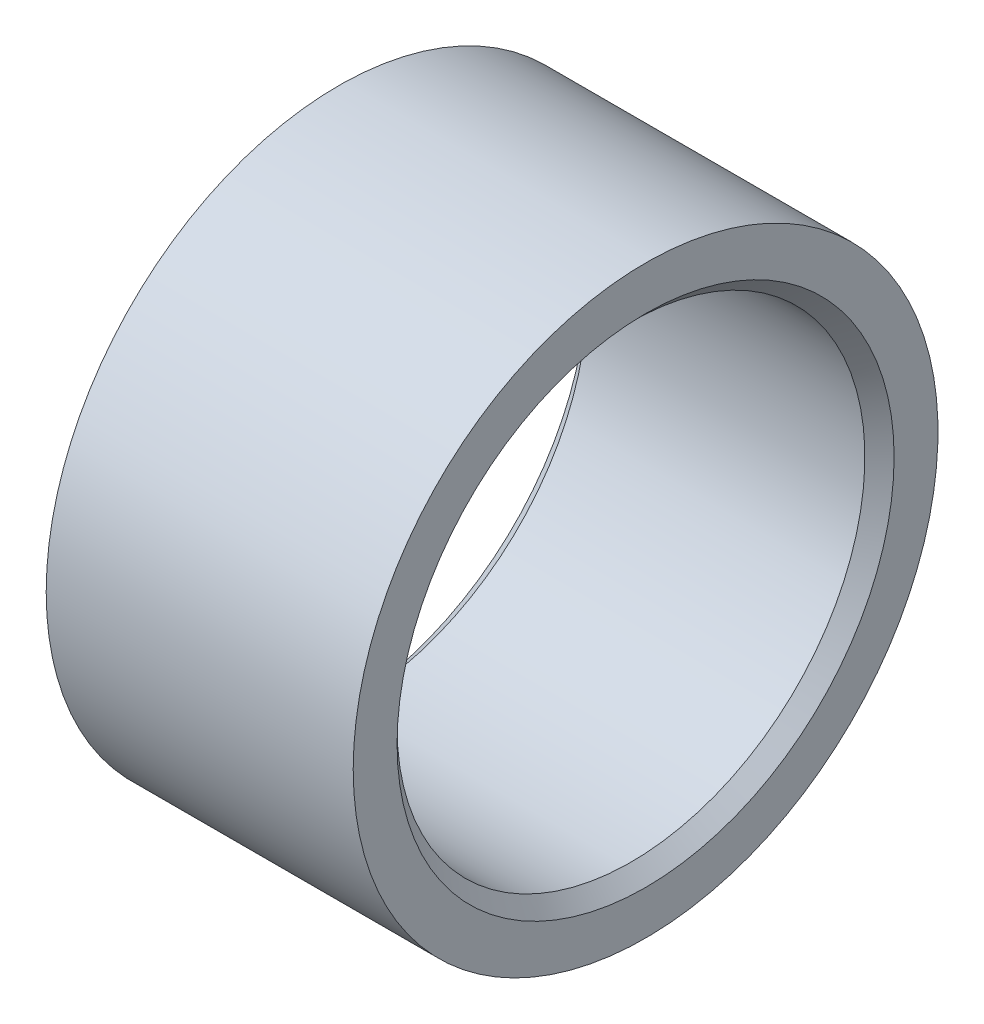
ISO-10303-21;
HEADER;
FILE_DESCRIPTION(('STEP AP214'),'2;1');
FILE_NAME('part.step','',(''),(''),'','','');
FILE_SCHEMA(('AUTOMOTIVE_DESIGN { 1 0 10303 214 1 1 1 1 }'));
ENDSEC;
DATA;
#1=APPLICATION_CONTEXT('core data for automotive mechanical design processes');
#2=APPLICATION_PROTOCOL_DEFINITION('international standard','automotive_design',2000,#1);
#3=PRODUCT_CONTEXT('',#1,'mechanical');
#4=PRODUCT('Part','Part','',(#3));
#5=PRODUCT_RELATED_PRODUCT_CATEGORY('part','',(#4));
#6=PRODUCT_DEFINITION_FORMATION('','',#4);
#7=PRODUCT_DEFINITION_CONTEXT('part definition',#1,'design');
#8=PRODUCT_DEFINITION('design','',#6,#7);
#9=PRODUCT_DEFINITION_SHAPE('','',#8);
#10=(LENGTH_UNIT() NAMED_UNIT(*) SI_UNIT(.MILLI.,.METRE.));
#11=(NAMED_UNIT(*) PLANE_ANGLE_UNIT() SI_UNIT($,.RADIAN.));
#12=(NAMED_UNIT(*) SI_UNIT($,.STERADIAN.) SOLID_ANGLE_UNIT());
#13=UNCERTAINTY_MEASURE_WITH_UNIT(LENGTH_MEASURE(1.E-05),#10,'distance_accuracy_value','');
#14=(GEOMETRIC_REPRESENTATION_CONTEXT(3) GLOBAL_UNCERTAINTY_ASSIGNED_CONTEXT((#13)) GLOBAL_UNIT_ASSIGNED_CONTEXT((#10,
#11,#12)) REPRESENTATION_CONTEXT('',''));
#15=CARTESIAN_POINT('',(0.,0.,0.));
#16=DIRECTION('',(0.,0.,1.));
#17=DIRECTION('',(1.,0.,0.));
#18=AXIS2_PLACEMENT_3D('',#15,#16,#17);
#19=CARTESIAN_POINT('',(0.,0.,0.));
#20=DIRECTION('',(-1.,0.,0.));
#21=DIRECTION('',(0.,0.,1.));
#22=AXIS2_PLACEMENT_3D('',#19,#20,#21);
#23=PLANE('',#22);
#24=CARTESIAN_POINT('',(0.,0.,0.));
#25=DIRECTION('',(-1.,0.,0.));
#26=DIRECTION('',(0.,0.,1.));
#27=AXIS2_PLACEMENT_3D('',#24,#25,#26);
#28=CIRCLE('',#27,17.);
#29=CARTESIAN_POINT('',(0.,0.,17.));
#30=VERTEX_POINT('',#29);
#31=EDGE_CURVE('E51',#30,#30,#28,.F.);
#32=ORIENTED_EDGE('',*,*,#31,.T.);
#33=EDGE_LOOP('',(#32));
#34=FACE_BOUND('',#33,.T.);
#35=CARTESIAN_POINT('',(0.,0.,0.));
#36=DIRECTION('',(-1.,0.,0.));
#37=DIRECTION('',(0.,0.,1.));
#38=AXIS2_PLACEMENT_3D('',#35,#36,#37);
#39=CIRCLE('',#38,20.);
#40=CARTESIAN_POINT('',(0.,0.,20.));
#41=VERTEX_POINT('',#40);
#42=EDGE_CURVE('E69',#41,#41,#39,.T.);
#43=ORIENTED_EDGE('',*,*,#42,.T.);
#44=EDGE_LOOP('',(#43));
#45=FACE_BOUND('',#44,.T.);
#46=ADVANCED_FACE('F43',(#34,#45),#23,.T.);
#47=CARTESIAN_POINT('',(0.,0.,0.));
#48=DIRECTION('',(-1.,0.,0.));
#49=DIRECTION('',(0.,0.,1.));
#50=AXIS2_PLACEMENT_3D('',#47,#48,#49);
#51=CYLINDRICAL_SURFACE('',#50,16.);
#52=CARTESIAN_POINT('',(1.00000000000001,0.,0.));
#53=DIRECTION('',(-1.,0.,0.));
#54=DIRECTION('',(0.,0.,1.));
#55=AXIS2_PLACEMENT_3D('',#52,#53,#54);
#56=CIRCLE('',#55,16.);
#57=CARTESIAN_POINT('',(1.00000000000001,0.,16.));
#58=VERTEX_POINT('',#57);
#59=EDGE_CURVE('E54',#58,#58,#56,.T.);
#60=ORIENTED_EDGE('',*,*,#59,.T.);
#61=EDGE_LOOP('',(#60));
#62=FACE_BOUND('',#61,.T.);
#63=CARTESIAN_POINT('',(20.,0.,0.));
#64=DIRECTION('',(-1.,0.,0.));
#65=DIRECTION('',(0.,0.,1.));
#66=AXIS2_PLACEMENT_3D('',#63,#64,#65);
#67=CIRCLE('',#66,16.);
#68=CARTESIAN_POINT('',(20.,0.,16.));
#69=VERTEX_POINT('',#68);
#70=EDGE_CURVE('E56',#69,#69,#67,.F.);
#71=ORIENTED_EDGE('',*,*,#70,.T.);
#72=EDGE_LOOP('',(#71));
#73=FACE_BOUND('',#72,.T.);
#74=ADVANCED_FACE('F85',(#62,#73),#51,.F.);
#75=CARTESIAN_POINT('',(21.,0.,0.));
#76=DIRECTION('',(-1.,0.,0.));
#77=DIRECTION('',(0.,0.,1.));
#78=AXIS2_PLACEMENT_3D('',#75,#76,#77);
#79=PLANE('',#78);
#80=CARTESIAN_POINT('',(21.,0.,0.));
#81=DIRECTION('',(-1.,0.,0.));
#82=DIRECTION('',(0.,0.,1.));
#83=AXIS2_PLACEMENT_3D('',#80,#81,#82);
#84=CIRCLE('',#83,17.);
#85=CARTESIAN_POINT('',(21.,0.,17.));
#86=VERTEX_POINT('',#85);
#87=EDGE_CURVE('E10',#86,#86,#84,.T.);
#88=ORIENTED_EDGE('',*,*,#87,.T.);
#89=EDGE_LOOP('',(#88));
#90=FACE_BOUND('',#89,.T.);
#91=CARTESIAN_POINT('',(21.,0.,0.));
#92=DIRECTION('',(-1.,0.,0.));
#93=DIRECTION('',(0.,0.,1.));
#94=AXIS2_PLACEMENT_3D('',#91,#92,#93);
#95=CIRCLE('',#94,20.);
#96=CARTESIAN_POINT('',(21.,0.,20.));
#97=VERTEX_POINT('',#96);
#98=EDGE_CURVE('E65',#97,#97,#95,.T.);
#99=ORIENTED_EDGE('',*,*,#98,.F.);
#100=EDGE_LOOP('',(#99));
#101=FACE_BOUND('',#100,.T.);
#102=ADVANCED_FACE('F73',(#90,#101),#79,.F.);
#103=CARTESIAN_POINT('',(0.,0.,0.));
#104=DIRECTION('',(-1.,0.,0.));
#105=DIRECTION('',(0.,0.,1.));
#106=AXIS2_PLACEMENT_3D('',#103,#104,#105);
#107=CYLINDRICAL_SURFACE('',#106,20.);
#108=ORIENTED_EDGE('',*,*,#98,.T.);
#109=EDGE_LOOP('',(#108));
#110=FACE_BOUND('',#109,.T.);
#111=ORIENTED_EDGE('',*,*,#42,.F.);
#112=EDGE_LOOP('',(#111));
#113=FACE_BOUND('',#112,.T.);
#114=ADVANCED_FACE('F75',(#110,#113),#107,.T.);
#115=CARTESIAN_POINT('',(1.00000000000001,0.,0.));
#116=DIRECTION('',(-1.,0.,0.));
#117=DIRECTION('',(0.,0.,1.));
#118=AXIS2_PLACEMENT_3D('',#115,#116,#117);
#119=CONICAL_SURFACE('',#118,16.,0.785398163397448);
#120=ORIENTED_EDGE('',*,*,#31,.F.);
#121=EDGE_LOOP('',(#120));
#122=FACE_BOUND('',#121,.T.);
#123=ORIENTED_EDGE('',*,*,#59,.F.);
#124=EDGE_LOOP('',(#123));
#125=FACE_BOUND('',#124,.T.);
#126=ADVANCED_FACE('F74',(#122,#125),#119,.F.);
#127=CARTESIAN_POINT('',(21.,0.,0.));
#128=DIRECTION('',(1.,0.,0.));
#129=DIRECTION('',(0.,0.,-1.));
#130=AXIS2_PLACEMENT_3D('',#127,#128,#129);
#131=CONICAL_SURFACE('',#130,17.,0.785398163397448);
#132=ORIENTED_EDGE('',*,*,#70,.F.);
#133=EDGE_LOOP('',(#132));
#134=FACE_BOUND('',#133,.T.);
#135=ORIENTED_EDGE('',*,*,#87,.F.);
#136=EDGE_LOOP('',(#135));
#137=FACE_BOUND('',#136,.T.);
#138=ADVANCED_FACE('F46',(#134,#137),#131,.F.);
#139=CLOSED_SHELL('',(#46,#74,#102,#114,#126,#138));
#140=MANIFOLD_SOLID_BREP('B2',#139);
#141=ADVANCED_BREP_SHAPE_REPRESENTATION('',(#18,#140),#14);
#142=SHAPE_DEFINITION_REPRESENTATION(#9,#141);
ENDSEC;
END-ISO-10303-21;
